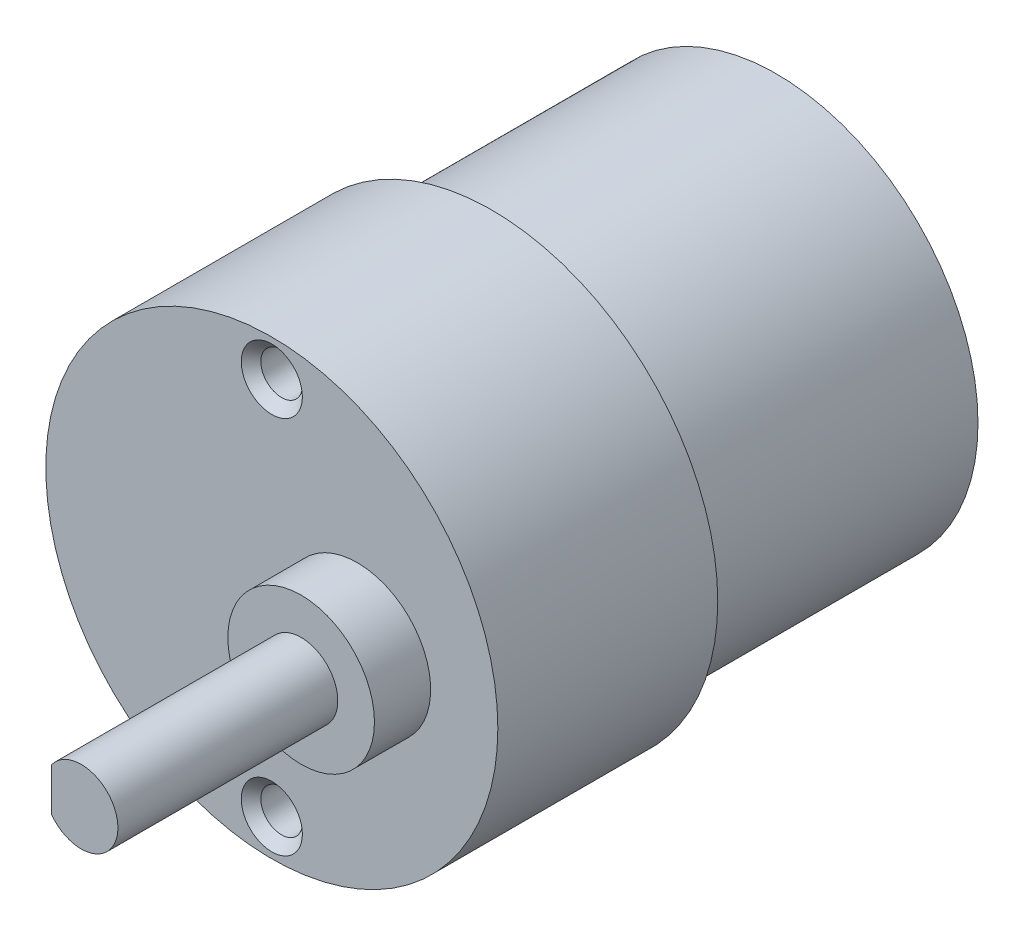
from build123d import *

# Parameters (mm, degrees)
SKETCH4_R                                       = 6
EXTRUDE3_DEPTH                                  = 4.6
EXTRUDE4_DEPTH                                  = 18
CSK_FOR_M3_FLAT_HEAD_MACHINE_SCREW1_D           = 3.4
CSK_FOR_M3_FLAT_HEAD_MACHINE_SCREW1_DEPTH       = 10
CSK_FOR_M3_FLAT_HEAD_MACHINE_SCREW1_CSINK_D     = 5
CSK_FOR_M3_FLAT_HEAD_MACHINE_SCREW1_CSINK_ANGLE = 90
CSK_FOR_M3_FLAT_HEAD_MACHINE_SCREW1_TIP         = 1.021463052
CSK_FOR_M3_FLAT_HEAD_MACHINE_SCREW2_D           = 3.4
CSK_FOR_M3_FLAT_HEAD_MACHINE_SCREW2_DEPTH       = 10
CSK_FOR_M3_FLAT_HEAD_MACHINE_SCREW2_CSINK_D     = 5
CSK_FOR_M3_FLAT_HEAD_MACHINE_SCREW2_CSINK_ANGLE = 90
CSK_FOR_M3_FLAT_HEAD_MACHINE_SCREW2_TIP         = 1.021463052


with BuildPart() as part:
    # Sketch1 → Revolve1 (revolve)
    with BuildSketch(Plane(origin=(0, 0, 0), x_dir=(1, 0, 0), z_dir=(0, 1, 0)), mode=Mode.PRIVATE) as revolve1_sk:
        Polygon((0, 0), (0, 18), (2, 18), (2, 41.3), (18.5, 41.3), (18.5, 0), align=None)
    revolve(revolve1_sk.sketch.rotate(Axis((18.5, 0, 0), (0, 0, -1)), 180), axis=Axis((18.5, 0, 0), (0, 0, -1)))

    # Sketch4 → Extrude3 (add)
    with BuildSketch(Plane.XY):
        with Locations(Location((25.5, 0, 0), (0, 0, 180))):
            Circle(SKETCH4_R)
    extrude(amount=EXTRUDE3_DEPTH)

    # Sketch5 → Extrude4 (add)
    with BuildSketch(Plane.XY.offset(4.6)):
        with BuildLine():
            Line((23.0644, -1.751528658), (23.0644, 1.751528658))
            ThreePointArc((23.0644, 1.751528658), (28.5, 0), (23.0644, -1.751528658))
        make_face()
    extrude(amount=EXTRUDE4_DEPTH)

    # CSK for M3 Flat Head Machine Screw1
    with Locations(Plane(origin=(18.5, -15.5, 0), x_dir=(1, 0, 0), z_dir=(0, 0, 1))):
        with Locations((0, 0)):
            CounterSinkHole(CSK_FOR_M3_FLAT_HEAD_MACHINE_SCREW1_D / 2, CSK_FOR_M3_FLAT_HEAD_MACHINE_SCREW1_CSINK_D / 2, depth=CSK_FOR_M3_FLAT_HEAD_MACHINE_SCREW1_DEPTH, counter_sink_angle=CSK_FOR_M3_FLAT_HEAD_MACHINE_SCREW1_CSINK_ANGLE)
            with Locations((0, 0, -(CSK_FOR_M3_FLAT_HEAD_MACHINE_SCREW1_DEPTH + CSK_FOR_M3_FLAT_HEAD_MACHINE_SCREW1_TIP / 2))):  # 118° drill point
                Cone(0, CSK_FOR_M3_FLAT_HEAD_MACHINE_SCREW1_D / 2, CSK_FOR_M3_FLAT_HEAD_MACHINE_SCREW1_TIP, mode=Mode.SUBTRACT)

    # CSK for M3 Flat Head Machine Screw2
    with Locations(Plane(origin=(18.5, 15.5, 0), x_dir=(1, 0, 0), z_dir=(0, 0, 1))):
        with Locations((0, 0)):
            CounterSinkHole(CSK_FOR_M3_FLAT_HEAD_MACHINE_SCREW2_D / 2, CSK_FOR_M3_FLAT_HEAD_MACHINE_SCREW2_CSINK_D / 2, depth=CSK_FOR_M3_FLAT_HEAD_MACHINE_SCREW2_DEPTH, counter_sink_angle=CSK_FOR_M3_FLAT_HEAD_MACHINE_SCREW2_CSINK_ANGLE)
            with Locations((0, 0, -(CSK_FOR_M3_FLAT_HEAD_MACHINE_SCREW2_DEPTH + CSK_FOR_M3_FLAT_HEAD_MACHINE_SCREW2_TIP / 2))):  # 118° drill point
                Cone(0, CSK_FOR_M3_FLAT_HEAD_MACHINE_SCREW2_D / 2, CSK_FOR_M3_FLAT_HEAD_MACHINE_SCREW2_TIP, mode=Mode.SUBTRACT)


solid = part.part
